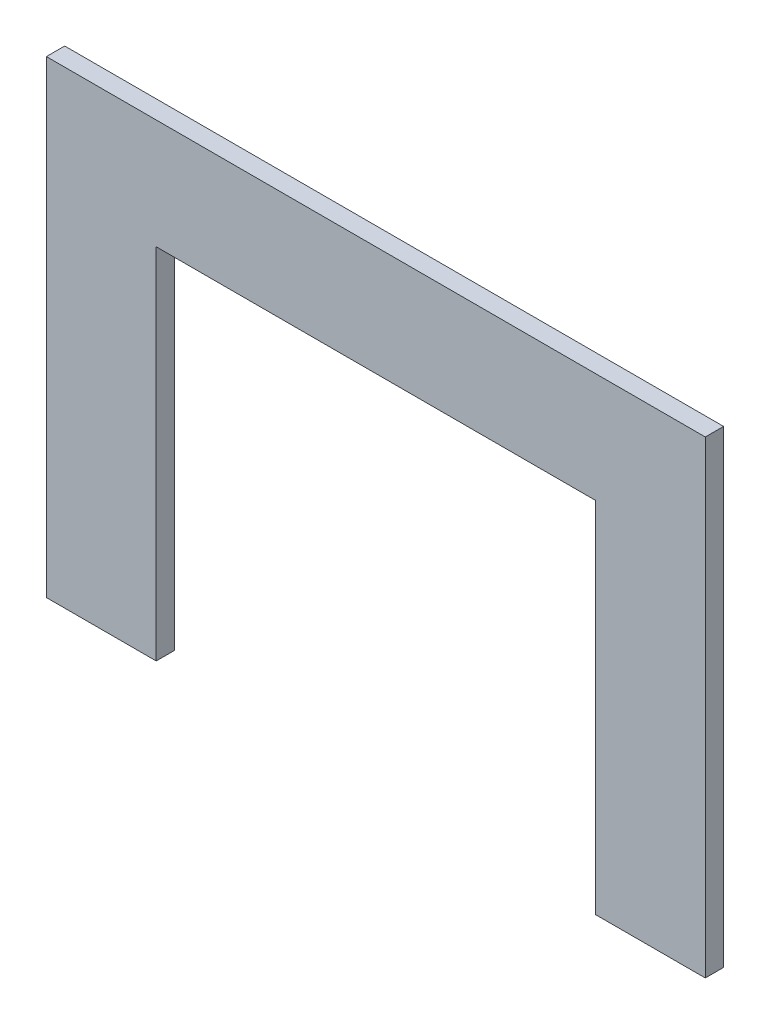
ISO-10303-21;
HEADER;
FILE_DESCRIPTION(('STEP AP214'),'2;1');
FILE_NAME('part.step','',(''),(''),'','','');
FILE_SCHEMA(('AUTOMOTIVE_DESIGN { 1 0 10303 214 1 1 1 1 }'));
ENDSEC;
DATA;
#1=APPLICATION_CONTEXT('core data for automotive mechanical design processes');
#2=APPLICATION_PROTOCOL_DEFINITION('international standard','automotive_design',2000,#1);
#3=PRODUCT_CONTEXT('',#1,'mechanical');
#4=PRODUCT('Part','Part','',(#3));
#5=PRODUCT_RELATED_PRODUCT_CATEGORY('part','',(#4));
#6=PRODUCT_DEFINITION_FORMATION('','',#4);
#7=PRODUCT_DEFINITION_CONTEXT('part definition',#1,'design');
#8=PRODUCT_DEFINITION('design','',#6,#7);
#9=PRODUCT_DEFINITION_SHAPE('','',#8);
#10=(LENGTH_UNIT() NAMED_UNIT(*) SI_UNIT(.MILLI.,.METRE.));
#11=(NAMED_UNIT(*) PLANE_ANGLE_UNIT() SI_UNIT($,.RADIAN.));
#12=(NAMED_UNIT(*) SI_UNIT($,.STERADIAN.) SOLID_ANGLE_UNIT());
#13=UNCERTAINTY_MEASURE_WITH_UNIT(LENGTH_MEASURE(1.E-05),#10,'distance_accuracy_value','');
#14=(GEOMETRIC_REPRESENTATION_CONTEXT(3) GLOBAL_UNCERTAINTY_ASSIGNED_CONTEXT((#13)) GLOBAL_UNIT_ASSIGNED_CONTEXT((#10,
#11,#12)) REPRESENTATION_CONTEXT('',''));
#15=CARTESIAN_POINT('',(0.,0.,0.));
#16=DIRECTION('',(0.,0.,1.));
#17=DIRECTION('',(1.,0.,0.));
#18=AXIS2_PLACEMENT_3D('',#15,#16,#17);
#19=CARTESIAN_POINT('',(-90.,64.,5.));
#20=DIRECTION('',(1.,0.,0.));
#21=DIRECTION('',(0.,0.,-1.));
#22=AXIS2_PLACEMENT_3D('',#19,#20,#21);
#23=PLANE('',#22);
#24=DIRECTION('',(0.,-1.,0.));
#25=VECTOR('',#24,1.);
#26=CARTESIAN_POINT('',(-90.,64.,0.));
#27=LINE('',#26,#25);
#28=CARTESIAN_POINT('',(-90.,64.,0.));
#29=VERTEX_POINT('',#28);
#30=CARTESIAN_POINT('',(-90.,-64.,0.));
#31=VERTEX_POINT('',#30);
#32=EDGE_CURVE('E94',#29,#31,#27,.T.);
#33=ORIENTED_EDGE('',*,*,#32,.T.);
#34=DIRECTION('',(0.,0.,-1.));
#35=VECTOR('',#34,1.);
#36=CARTESIAN_POINT('',(-90.,-64.,5.));
#37=LINE('',#36,#35);
#38=CARTESIAN_POINT('',(-90.,-64.,5.));
#39=VERTEX_POINT('',#38);
#40=EDGE_CURVE('E11',#39,#31,#37,.T.);
#41=ORIENTED_EDGE('',*,*,#40,.F.);
#42=DIRECTION('',(0.,-1.,0.));
#43=VECTOR('',#42,1.);
#44=CARTESIAN_POINT('',(-90.,64.,5.));
#45=LINE('',#44,#43);
#46=CARTESIAN_POINT('',(-90.,64.,5.));
#47=VERTEX_POINT('',#46);
#48=EDGE_CURVE('E121',#47,#39,#45,.T.);
#49=ORIENTED_EDGE('',*,*,#48,.F.);
#50=DIRECTION('',(0.,0.,-1.));
#51=VECTOR('',#50,1.);
#52=CARTESIAN_POINT('',(-90.,64.,5.));
#53=LINE('',#52,#51);
#54=EDGE_CURVE('E107',#47,#29,#53,.T.);
#55=ORIENTED_EDGE('',*,*,#54,.T.);
#56=EDGE_LOOP('',(#33,#41,#49,#55));
#57=FACE_BOUND('',#56,.T.);
#58=ADVANCED_FACE('F26',(#57),#23,.F.);
#59=CARTESIAN_POINT('',(-90.,-64.,5.));
#60=DIRECTION('',(0.,1.,0.));
#61=DIRECTION('',(0.,0.,1.));
#62=AXIS2_PLACEMENT_3D('',#59,#60,#61);
#63=PLANE('',#62);
#64=DIRECTION('',(1.,0.,0.));
#65=VECTOR('',#64,1.);
#66=CARTESIAN_POINT('',(-90.,-64.,0.));
#67=LINE('',#66,#65);
#68=CARTESIAN_POINT('',(-60.,-64.,0.));
#69=VERTEX_POINT('',#68);
#70=EDGE_CURVE('E90',#31,#69,#67,.T.);
#71=ORIENTED_EDGE('',*,*,#70,.T.);
#72=DIRECTION('',(0.,0.,-1.));
#73=VECTOR('',#72,1.);
#74=CARTESIAN_POINT('',(-60.,-64.,5.));
#75=LINE('',#74,#73);
#76=CARTESIAN_POINT('',(-60.,-64.,5.));
#77=VERTEX_POINT('',#76);
#78=EDGE_CURVE('E33',#77,#69,#75,.T.);
#79=ORIENTED_EDGE('',*,*,#78,.F.);
#80=DIRECTION('',(1.,0.,0.));
#81=VECTOR('',#80,1.);
#82=CARTESIAN_POINT('',(-90.,-64.,5.));
#83=LINE('',#82,#81);
#84=EDGE_CURVE('E103',#39,#77,#83,.T.);
#85=ORIENTED_EDGE('',*,*,#84,.F.);
#86=ORIENTED_EDGE('',*,*,#40,.T.);
#87=EDGE_LOOP('',(#71,#79,#85,#86));
#88=FACE_BOUND('',#87,.T.);
#89=ADVANCED_FACE('F102',(#88),#63,.F.);
#90=CARTESIAN_POINT('',(-60.,-64.,5.));
#91=DIRECTION('',(-1.,0.,0.));
#92=DIRECTION('',(0.,0.,1.));
#93=AXIS2_PLACEMENT_3D('',#90,#91,#92);
#94=PLANE('',#93);
#95=DIRECTION('',(0.,1.,0.));
#96=VECTOR('',#95,1.);
#97=CARTESIAN_POINT('',(-60.,-64.,0.));
#98=LINE('',#97,#96);
#99=CARTESIAN_POINT('',(-60.,34.,0.));
#100=VERTEX_POINT('',#99);
#101=EDGE_CURVE('E96',#69,#100,#98,.T.);
#102=ORIENTED_EDGE('',*,*,#101,.T.);
#103=DIRECTION('',(0.,0.,-1.));
#104=VECTOR('',#103,1.);
#105=CARTESIAN_POINT('',(-60.,34.,5.));
#106=LINE('',#105,#104);
#107=CARTESIAN_POINT('',(-60.,34.,5.));
#108=VERTEX_POINT('',#107);
#109=EDGE_CURVE('E147',#108,#100,#106,.T.);
#110=ORIENTED_EDGE('',*,*,#109,.F.);
#111=DIRECTION('',(0.,1.,0.));
#112=VECTOR('',#111,1.);
#113=CARTESIAN_POINT('',(-60.,-64.,5.));
#114=LINE('',#113,#112);
#115=EDGE_CURVE('E124',#77,#108,#114,.T.);
#116=ORIENTED_EDGE('',*,*,#115,.F.);
#117=ORIENTED_EDGE('',*,*,#78,.T.);
#118=EDGE_LOOP('',(#102,#110,#116,#117));
#119=FACE_BOUND('',#118,.T.);
#120=ADVANCED_FACE('F151',(#119),#94,.F.);
#121=CARTESIAN_POINT('',(-60.,34.,5.));
#122=DIRECTION('',(0.,1.,0.));
#123=DIRECTION('',(0.,0.,1.));
#124=AXIS2_PLACEMENT_3D('',#121,#122,#123);
#125=PLANE('',#124);
#126=DIRECTION('',(1.,0.,0.));
#127=VECTOR('',#126,1.);
#128=CARTESIAN_POINT('',(-60.,34.,0.));
#129=LINE('',#128,#127);
#130=CARTESIAN_POINT('',(60.,34.,0.));
#131=VERTEX_POINT('',#130);
#132=EDGE_CURVE('E111',#100,#131,#129,.T.);
#133=ORIENTED_EDGE('',*,*,#132,.T.);
#134=DIRECTION('',(0.,0.,-1.));
#135=VECTOR('',#134,1.);
#136=CARTESIAN_POINT('',(60.,34.,5.));
#137=LINE('',#136,#135);
#138=CARTESIAN_POINT('',(60.,34.,5.));
#139=VERTEX_POINT('',#138);
#140=EDGE_CURVE('E144',#139,#131,#137,.T.);
#141=ORIENTED_EDGE('',*,*,#140,.F.);
#142=DIRECTION('',(1.,0.,0.));
#143=VECTOR('',#142,1.);
#144=CARTESIAN_POINT('',(-60.,34.,5.));
#145=LINE('',#144,#143);
#146=EDGE_CURVE('E126',#108,#139,#145,.T.);
#147=ORIENTED_EDGE('',*,*,#146,.F.);
#148=ORIENTED_EDGE('',*,*,#109,.T.);
#149=EDGE_LOOP('',(#133,#141,#147,#148));
#150=FACE_BOUND('',#149,.T.);
#151=ADVANCED_FACE('F159',(#150),#125,.F.);
#152=CARTESIAN_POINT('',(60.,-64.,5.));
#153=DIRECTION('',(1.,0.,0.));
#154=DIRECTION('',(0.,0.,-1.));
#155=AXIS2_PLACEMENT_3D('',#152,#153,#154);
#156=PLANE('',#155);
#157=DIRECTION('',(0.,-1.,0.));
#158=VECTOR('',#157,1.);
#159=CARTESIAN_POINT('',(60.,-64.,0.));
#160=LINE('',#159,#158);
#161=CARTESIAN_POINT('',(60.,-64.,0.));
#162=VERTEX_POINT('',#161);
#163=EDGE_CURVE('E113',#131,#162,#160,.T.);
#164=ORIENTED_EDGE('',*,*,#163,.T.);
#165=DIRECTION('',(0.,0.,-1.));
#166=VECTOR('',#165,1.);
#167=CARTESIAN_POINT('',(60.,-64.,5.));
#168=LINE('',#167,#166);
#169=CARTESIAN_POINT('',(60.,-64.,5.));
#170=VERTEX_POINT('',#169);
#171=EDGE_CURVE('E141',#170,#162,#168,.T.);
#172=ORIENTED_EDGE('',*,*,#171,.F.);
#173=DIRECTION('',(0.,-1.,0.));
#174=VECTOR('',#173,1.);
#175=CARTESIAN_POINT('',(60.,-64.,5.));
#176=LINE('',#175,#174);
#177=EDGE_CURVE('E128',#139,#170,#176,.T.);
#178=ORIENTED_EDGE('',*,*,#177,.F.);
#179=ORIENTED_EDGE('',*,*,#140,.T.);
#180=EDGE_LOOP('',(#164,#172,#178,#179));
#181=FACE_BOUND('',#180,.T.);
#182=ADVANCED_FACE('F162',(#181),#156,.F.);
#183=CARTESIAN_POINT('',(60.,-64.,5.));
#184=DIRECTION('',(0.,1.,0.));
#185=DIRECTION('',(0.,0.,1.));
#186=AXIS2_PLACEMENT_3D('',#183,#184,#185);
#187=PLANE('',#186);
#188=DIRECTION('',(1.,0.,0.));
#189=VECTOR('',#188,1.);
#190=CARTESIAN_POINT('',(60.,-64.,0.));
#191=LINE('',#190,#189);
#192=CARTESIAN_POINT('',(90.,-64.,0.));
#193=VERTEX_POINT('',#192);
#194=EDGE_CURVE('E115',#162,#193,#191,.T.);
#195=ORIENTED_EDGE('',*,*,#194,.T.);
#196=DIRECTION('',(0.,0.,-1.));
#197=VECTOR('',#196,1.);
#198=CARTESIAN_POINT('',(90.,-64.,5.));
#199=LINE('',#198,#197);
#200=CARTESIAN_POINT('',(90.,-64.,5.));
#201=VERTEX_POINT('',#200);
#202=EDGE_CURVE('E138',#201,#193,#199,.T.);
#203=ORIENTED_EDGE('',*,*,#202,.F.);
#204=DIRECTION('',(1.,0.,0.));
#205=VECTOR('',#204,1.);
#206=CARTESIAN_POINT('',(60.,-64.,5.));
#207=LINE('',#206,#205);
#208=EDGE_CURVE('E130',#170,#201,#207,.T.);
#209=ORIENTED_EDGE('',*,*,#208,.F.);
#210=ORIENTED_EDGE('',*,*,#171,.T.);
#211=EDGE_LOOP('',(#195,#203,#209,#210));
#212=FACE_BOUND('',#211,.T.);
#213=ADVANCED_FACE('F167',(#212),#187,.F.);
#214=CARTESIAN_POINT('',(90.,64.,5.));
#215=DIRECTION('',(-1.,0.,0.));
#216=DIRECTION('',(0.,0.,1.));
#217=AXIS2_PLACEMENT_3D('',#214,#215,#216);
#218=PLANE('',#217);
#219=DIRECTION('',(0.,1.,0.));
#220=VECTOR('',#219,1.);
#221=CARTESIAN_POINT('',(90.,64.,0.));
#222=LINE('',#221,#220);
#223=CARTESIAN_POINT('',(90.,64.,0.));
#224=VERTEX_POINT('',#223);
#225=EDGE_CURVE('E117',#193,#224,#222,.T.);
#226=ORIENTED_EDGE('',*,*,#225,.T.);
#227=DIRECTION('',(0.,0.,-1.));
#228=VECTOR('',#227,1.);
#229=CARTESIAN_POINT('',(90.,64.,5.));
#230=LINE('',#229,#228);
#231=CARTESIAN_POINT('',(90.,64.,5.));
#232=VERTEX_POINT('',#231);
#233=EDGE_CURVE('E135',#232,#224,#230,.T.);
#234=ORIENTED_EDGE('',*,*,#233,.F.);
#235=DIRECTION('',(0.,1.,0.));
#236=VECTOR('',#235,1.);
#237=CARTESIAN_POINT('',(90.,64.,5.));
#238=LINE('',#237,#236);
#239=EDGE_CURVE('E45',#201,#232,#238,.T.);
#240=ORIENTED_EDGE('',*,*,#239,.F.);
#241=ORIENTED_EDGE('',*,*,#202,.T.);
#242=EDGE_LOOP('',(#226,#234,#240,#241));
#243=FACE_BOUND('',#242,.T.);
#244=ADVANCED_FACE('F170',(#243),#218,.F.);
#245=CARTESIAN_POINT('',(-90.,64.,5.));
#246=DIRECTION('',(0.,-1.,0.));
#247=DIRECTION('',(0.,0.,-1.));
#248=AXIS2_PLACEMENT_3D('',#245,#246,#247);
#249=PLANE('',#248);
#250=DIRECTION('',(-1.,0.,0.));
#251=VECTOR('',#250,1.);
#252=CARTESIAN_POINT('',(-90.,64.,0.));
#253=LINE('',#252,#251);
#254=EDGE_CURVE('E119',#224,#29,#253,.T.);
#255=ORIENTED_EDGE('',*,*,#254,.T.);
#256=ORIENTED_EDGE('',*,*,#54,.F.);
#257=DIRECTION('',(-1.,0.,0.));
#258=VECTOR('',#257,1.);
#259=CARTESIAN_POINT('',(-90.,64.,5.));
#260=LINE('',#259,#258);
#261=EDGE_CURVE('E40',#232,#47,#260,.T.);
#262=ORIENTED_EDGE('',*,*,#261,.F.);
#263=ORIENTED_EDGE('',*,*,#233,.T.);
#264=EDGE_LOOP('',(#255,#256,#262,#263));
#265=FACE_BOUND('',#264,.T.);
#266=ADVANCED_FACE('F172',(#265),#249,.F.);
#267=CARTESIAN_POINT('',(-90.,-64.,5.));
#268=DIRECTION('',(0.,0.,1.));
#269=DIRECTION('',(1.,0.,0.));
#270=AXIS2_PLACEMENT_3D('',#267,#268,#269);
#271=PLANE('',#270);
#272=ORIENTED_EDGE('',*,*,#48,.T.);
#273=ORIENTED_EDGE('',*,*,#84,.T.);
#274=ORIENTED_EDGE('',*,*,#115,.T.);
#275=ORIENTED_EDGE('',*,*,#146,.T.);
#276=ORIENTED_EDGE('',*,*,#177,.T.);
#277=ORIENTED_EDGE('',*,*,#208,.T.);
#278=ORIENTED_EDGE('',*,*,#239,.T.);
#279=ORIENTED_EDGE('',*,*,#261,.T.);
#280=EDGE_LOOP('',(#272,#273,#274,#275,#276,#277,#278,#279));
#281=FACE_BOUND('',#280,.T.);
#282=ADVANCED_FACE('F154',(#281),#271,.T.);
#283=CARTESIAN_POINT('',(-90.,-64.,0.));
#284=DIRECTION('',(0.,0.,1.));
#285=DIRECTION('',(1.,0.,0.));
#286=AXIS2_PLACEMENT_3D('',#283,#284,#285);
#287=PLANE('',#286);
#288=ORIENTED_EDGE('',*,*,#32,.F.);
#289=ORIENTED_EDGE('',*,*,#254,.F.);
#290=ORIENTED_EDGE('',*,*,#225,.F.);
#291=ORIENTED_EDGE('',*,*,#194,.F.);
#292=ORIENTED_EDGE('',*,*,#163,.F.);
#293=ORIENTED_EDGE('',*,*,#132,.F.);
#294=ORIENTED_EDGE('',*,*,#101,.F.);
#295=ORIENTED_EDGE('',*,*,#70,.F.);
#296=EDGE_LOOP('',(#288,#289,#290,#291,#292,#293,#294,#295));
#297=FACE_BOUND('',#296,.T.);
#298=ADVANCED_FACE('F91',(#297),#287,.F.);
#299=CLOSED_SHELL('',(#58,#89,#120,#151,#182,#213,#244,#266,#282,#298));
#300=MANIFOLD_SOLID_BREP('B2',#299);
#301=ADVANCED_BREP_SHAPE_REPRESENTATION('',(#18,#300),#14);
#302=SHAPE_DEFINITION_REPRESENTATION(#9,#301);
ENDSEC;
END-ISO-10303-21;
